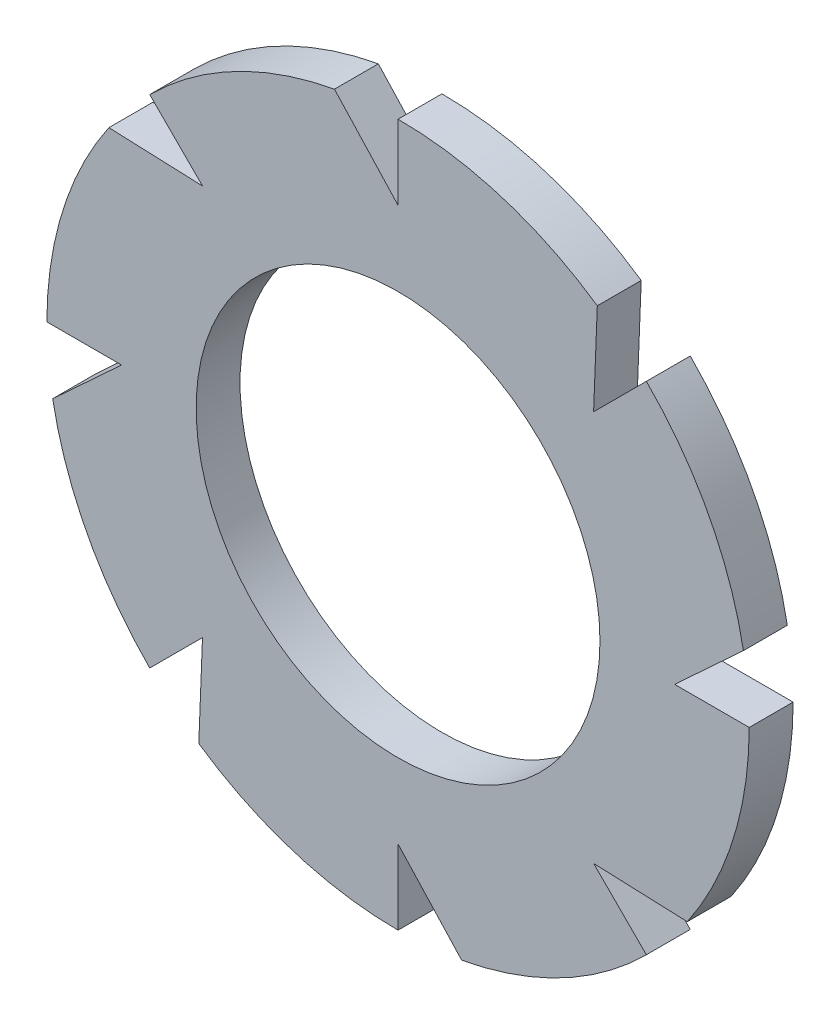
ISO-10303-21;
HEADER;
FILE_DESCRIPTION(('STEP AP214'),'2;1');
FILE_NAME('part.step','',(''),(''),'','','');
FILE_SCHEMA(('AUTOMOTIVE_DESIGN { 1 0 10303 214 1 1 1 1 }'));
ENDSEC;
DATA;
#1=APPLICATION_CONTEXT('core data for automotive mechanical design processes');
#2=APPLICATION_PROTOCOL_DEFINITION('international standard','automotive_design',2000,#1);
#3=PRODUCT_CONTEXT('',#1,'mechanical');
#4=PRODUCT('Part','Part','',(#3));
#5=PRODUCT_RELATED_PRODUCT_CATEGORY('part','',(#4));
#6=PRODUCT_DEFINITION_FORMATION('','',#4);
#7=PRODUCT_DEFINITION_CONTEXT('part definition',#1,'design');
#8=PRODUCT_DEFINITION('design','',#6,#7);
#9=PRODUCT_DEFINITION_SHAPE('','',#8);
#10=(LENGTH_UNIT() NAMED_UNIT(*) SI_UNIT(.MILLI.,.METRE.));
#11=(NAMED_UNIT(*) PLANE_ANGLE_UNIT() SI_UNIT($,.RADIAN.));
#12=(NAMED_UNIT(*) SI_UNIT($,.STERADIAN.) SOLID_ANGLE_UNIT());
#13=UNCERTAINTY_MEASURE_WITH_UNIT(LENGTH_MEASURE(1.E-05),#10,'distance_accuracy_value','');
#14=(GEOMETRIC_REPRESENTATION_CONTEXT(3) GLOBAL_UNCERTAINTY_ASSIGNED_CONTEXT((#13)) GLOBAL_UNIT_ASSIGNED_CONTEXT((#10,
#11,#12)) REPRESENTATION_CONTEXT('',''));
#15=CARTESIAN_POINT('',(0.,0.,0.));
#16=DIRECTION('',(0.,0.,1.));
#17=DIRECTION('',(1.,0.,0.));
#18=AXIS2_PLACEMENT_3D('',#15,#16,#17);
#19=CARTESIAN_POINT('',(0.,0.,-0.5));
#20=DIRECTION('',(0.,0.,1.));
#21=DIRECTION('',(1.,0.,0.));
#22=AXIS2_PLACEMENT_3D('',#19,#20,#21);
#23=CYLINDRICAL_SURFACE('',#22,4.);
#24=DIRECTION('',(0.,0.,1.));
#25=VECTOR('',#24,1.);
#26=CARTESIAN_POINT('',(2.82842712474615,2.82842712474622,-0.5));
#27=LINE('',#26,#25);
#28=CARTESIAN_POINT('',(2.82842712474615,2.82842712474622,-0.5));
#29=VERTEX_POINT('',#28);
#30=CARTESIAN_POINT('',(2.82842712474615,2.82842712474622,-1.70530256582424E-10));
#31=VERTEX_POINT('',#30);
#32=EDGE_CURVE('E198',#29,#31,#27,.T.);
#33=ORIENTED_EDGE('',*,*,#32,.T.);
#34=CARTESIAN_POINT('',(0.,0.,0.));
#35=DIRECTION('',(0.,0.,1.));
#36=DIRECTION('',(1.,0.,0.));
#37=AXIS2_PLACEMENT_3D('',#34,#35,#36);
#38=CIRCLE('',#37,4.);
#39=CARTESIAN_POINT('',(3.93387713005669,0.72430016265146,0.));
#40=VERTEX_POINT('',#39);
#41=EDGE_CURVE('E373',#40,#31,#38,.T.);
#42=ORIENTED_EDGE('',*,*,#41,.F.);
#43=DIRECTION('',(0.,0.,1.));
#44=VECTOR('',#43,1.);
#45=CARTESIAN_POINT('',(3.93387713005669,0.72430016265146,-0.5));
#46=LINE('',#45,#44);
#47=CARTESIAN_POINT('',(3.93387713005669,0.72430016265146,-0.5));
#48=VERTEX_POINT('',#47);
#49=EDGE_CURVE('E55',#48,#40,#46,.T.);
#50=ORIENTED_EDGE('',*,*,#49,.F.);
#51=CARTESIAN_POINT('',(0.,0.,-0.5));
#52=DIRECTION('',(0.,0.,1.));
#53=DIRECTION('',(1.,0.,0.));
#54=AXIS2_PLACEMENT_3D('',#51,#52,#53);
#55=CIRCLE('',#54,4.);
#56=EDGE_CURVE('E384',#48,#29,#55,.T.);
#57=ORIENTED_EDGE('',*,*,#56,.T.);
#58=EDGE_LOOP('',(#33,#42,#50,#57));
#59=FACE_BOUND('',#58,.T.);
#60=ADVANCED_FACE('F33',(#59),#23,.T.);
#61=DIRECTION('',(0.,0.,1.));
#62=VECTOR('',#61,1.);
#63=CARTESIAN_POINT('',(4.,0.,-0.5));
#64=LINE('',#63,#62);
#65=CARTESIAN_POINT('',(4.,0.,-0.5));
#66=VERTEX_POINT('',#65);
#67=CARTESIAN_POINT('',(4.,0.,-1.70530256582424E-10));
#68=VERTEX_POINT('',#67);
#69=EDGE_CURVE('E227',#66,#68,#64,.T.);
#70=ORIENTED_EDGE('',*,*,#69,.T.);
#71=CARTESIAN_POINT('',(3.29382875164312,-2.2695136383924,0.));
#72=VERTEX_POINT('',#71);
#73=EDGE_CURVE('E368',#72,#68,#38,.T.);
#74=ORIENTED_EDGE('',*,*,#73,.F.);
#75=DIRECTION('',(0.,0.,1.));
#76=VECTOR('',#75,1.);
#77=CARTESIAN_POINT('',(3.29382875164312,-2.2695136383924,-0.5));
#78=LINE('',#77,#76);
#79=CARTESIAN_POINT('',(3.29382875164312,-2.2695136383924,-0.5));
#80=VERTEX_POINT('',#79);
#81=EDGE_CURVE('E245',#80,#72,#78,.T.);
#82=ORIENTED_EDGE('',*,*,#81,.F.);
#83=EDGE_CURVE('E385',#80,#66,#55,.T.);
#84=ORIENTED_EDGE('',*,*,#83,.T.);
#85=EDGE_LOOP('',(#70,#74,#82,#84));
#86=FACE_BOUND('',#85,.T.);
#87=ADVANCED_FACE('F440',(#86),#23,.T.);
#88=DIRECTION('',(0.,0.,1.));
#89=VECTOR('',#88,1.);
#90=CARTESIAN_POINT('',(2.82842712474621,-2.82842712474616,-0.5));
#91=LINE('',#90,#89);
#92=CARTESIAN_POINT('',(2.82842712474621,-2.82842712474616,-0.5));
#93=VERTEX_POINT('',#92);
#94=CARTESIAN_POINT('',(2.82842712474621,-2.82842712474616,-1.70530256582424E-10));
#95=VERTEX_POINT('',#94);
#96=EDGE_CURVE('E242',#93,#95,#91,.T.);
#97=ORIENTED_EDGE('',*,*,#96,.T.);
#98=CARTESIAN_POINT('',(0.724300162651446,-3.93387713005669,0.));
#99=VERTEX_POINT('',#98);
#100=EDGE_CURVE('E372',#99,#95,#38,.T.);
#101=ORIENTED_EDGE('',*,*,#100,.F.);
#102=DIRECTION('',(0.,0.,1.));
#103=VECTOR('',#102,1.);
#104=CARTESIAN_POINT('',(0.724300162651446,-3.93387713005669,-0.5));
#105=LINE('',#104,#103);
#106=CARTESIAN_POINT('',(0.724300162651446,-3.93387713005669,-0.5));
#107=VERTEX_POINT('',#106);
#108=EDGE_CURVE('E261',#107,#99,#105,.T.);
#109=ORIENTED_EDGE('',*,*,#108,.F.);
#110=EDGE_CURVE('E388',#107,#93,#55,.T.);
#111=ORIENTED_EDGE('',*,*,#110,.T.);
#112=EDGE_LOOP('',(#97,#101,#109,#111));
#113=FACE_BOUND('',#112,.T.);
#114=ADVANCED_FACE('F434',(#113),#23,.T.);
#115=DIRECTION('',(0.,0.,1.));
#116=VECTOR('',#115,1.);
#117=CARTESIAN_POINT('',(0.,-4.,-0.5));
#118=LINE('',#117,#116);
#119=CARTESIAN_POINT('',(0.,-4.,-0.5));
#120=VERTEX_POINT('',#119);
#121=CARTESIAN_POINT('',(0.,-4.,-1.70530256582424E-10));
#122=VERTEX_POINT('',#121);
#123=EDGE_CURVE('E258',#120,#122,#118,.T.);
#124=ORIENTED_EDGE('',*,*,#123,.T.);
#125=CARTESIAN_POINT('',(-2.26951363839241,-3.29382875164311,0.));
#126=VERTEX_POINT('',#125);
#127=EDGE_CURVE('E375',#126,#122,#38,.T.);
#128=ORIENTED_EDGE('',*,*,#127,.F.);
#129=DIRECTION('',(0.,0.,1.));
#130=VECTOR('',#129,1.);
#131=CARTESIAN_POINT('',(-2.26951363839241,-3.29382875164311,-0.5));
#132=LINE('',#131,#130);
#133=CARTESIAN_POINT('',(-2.26951363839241,-3.29382875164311,-0.5));
#134=VERTEX_POINT('',#133);
#135=EDGE_CURVE('E277',#134,#126,#132,.T.);
#136=ORIENTED_EDGE('',*,*,#135,.F.);
#137=EDGE_CURVE('E391',#134,#120,#55,.T.);
#138=ORIENTED_EDGE('',*,*,#137,.T.);
#139=EDGE_LOOP('',(#124,#128,#136,#138));
#140=FACE_BOUND('',#139,.T.);
#141=ADVANCED_FACE('F427',(#140),#23,.T.);
#142=DIRECTION('',(0.,0.,1.));
#143=VECTOR('',#142,1.);
#144=CARTESIAN_POINT('',(-2.82842712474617,-2.8284271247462,-0.5));
#145=LINE('',#144,#143);
#146=CARTESIAN_POINT('',(-2.82842712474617,-2.8284271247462,-0.5));
#147=VERTEX_POINT('',#146);
#148=CARTESIAN_POINT('',(-2.82842712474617,-2.8284271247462,-1.70530256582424E-10));
#149=VERTEX_POINT('',#148);
#150=EDGE_CURVE('E274',#147,#149,#145,.T.);
#151=ORIENTED_EDGE('',*,*,#150,.T.);
#152=CARTESIAN_POINT('',(-3.93387713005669,-0.724300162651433,0.));
#153=VERTEX_POINT('',#152);
#154=EDGE_CURVE('E420',#153,#149,#38,.T.);
#155=ORIENTED_EDGE('',*,*,#154,.F.);
#156=DIRECTION('',(0.,0.,1.));
#157=VECTOR('',#156,1.);
#158=CARTESIAN_POINT('',(-3.93387713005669,-0.724300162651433,-0.5));
#159=LINE('',#158,#157);
#160=CARTESIAN_POINT('',(-3.93387713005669,-0.724300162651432,-0.5));
#161=VERTEX_POINT('',#160);
#162=EDGE_CURVE('E293',#161,#153,#159,.T.);
#163=ORIENTED_EDGE('',*,*,#162,.F.);
#164=EDGE_CURVE('E396',#161,#147,#55,.T.);
#165=ORIENTED_EDGE('',*,*,#164,.T.);
#166=EDGE_LOOP('',(#151,#155,#163,#165));
#167=FACE_BOUND('',#166,.T.);
#168=ADVANCED_FACE('F457',(#167),#23,.T.);
#169=DIRECTION('',(0.,0.,1.));
#170=VECTOR('',#169,1.);
#171=CARTESIAN_POINT('',(-4.,0.,-0.5));
#172=LINE('',#171,#170);
#173=CARTESIAN_POINT('',(-4.,0.,-0.5));
#174=VERTEX_POINT('',#173);
#175=CARTESIAN_POINT('',(-4.,0.,-1.70530256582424E-10));
#176=VERTEX_POINT('',#175);
#177=EDGE_CURVE('E290',#174,#176,#172,.T.);
#178=ORIENTED_EDGE('',*,*,#177,.T.);
#179=CARTESIAN_POINT('',(-3.2938287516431,2.26951363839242,0.));
#180=VERTEX_POINT('',#179);
#181=EDGE_CURVE('E344',#180,#176,#38,.T.);
#182=ORIENTED_EDGE('',*,*,#181,.F.);
#183=DIRECTION('',(0.,0.,1.));
#184=VECTOR('',#183,1.);
#185=CARTESIAN_POINT('',(-3.2938287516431,2.26951363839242,-0.5));
#186=LINE('',#185,#184);
#187=CARTESIAN_POINT('',(-3.29382875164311,2.26951363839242,-0.5));
#188=VERTEX_POINT('',#187);
#189=EDGE_CURVE('E309',#188,#180,#186,.T.);
#190=ORIENTED_EDGE('',*,*,#189,.F.);
#191=EDGE_CURVE('E340',#188,#174,#55,.T.);
#192=ORIENTED_EDGE('',*,*,#191,.T.);
#193=EDGE_LOOP('',(#178,#182,#190,#192));
#194=FACE_BOUND('',#193,.T.);
#195=ADVANCED_FACE('F408',(#194),#23,.T.);
#196=DIRECTION('',(0.,0.,1.));
#197=VECTOR('',#196,1.);
#198=CARTESIAN_POINT('',(-2.82842712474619,2.82842712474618,-0.5));
#199=LINE('',#198,#197);
#200=CARTESIAN_POINT('',(-2.82842712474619,2.82842712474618,-0.5));
#201=VERTEX_POINT('',#200);
#202=CARTESIAN_POINT('',(-2.82842712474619,2.82842712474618,-1.70530256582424E-10));
#203=VERTEX_POINT('',#202);
#204=EDGE_CURVE('E306',#201,#203,#199,.T.);
#205=ORIENTED_EDGE('',*,*,#204,.T.);
#206=CARTESIAN_POINT('',(-0.724300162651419,3.9338771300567,0.));
#207=VERTEX_POINT('',#206);
#208=EDGE_CURVE('E341',#207,#203,#38,.T.);
#209=ORIENTED_EDGE('',*,*,#208,.F.);
#210=DIRECTION('',(0.,0.,1.));
#211=VECTOR('',#210,1.);
#212=CARTESIAN_POINT('',(-0.724300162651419,3.9338771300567,-0.5));
#213=LINE('',#212,#211);
#214=CARTESIAN_POINT('',(-0.724300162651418,3.9338771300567,-0.5));
#215=VERTEX_POINT('',#214);
#216=EDGE_CURVE('E325',#215,#207,#213,.T.);
#217=ORIENTED_EDGE('',*,*,#216,.F.);
#218=EDGE_CURVE('E336',#215,#201,#55,.T.);
#219=ORIENTED_EDGE('',*,*,#218,.T.);
#220=EDGE_LOOP('',(#205,#209,#217,#219));
#221=FACE_BOUND('',#220,.T.);
#222=ADVANCED_FACE('F446',(#221),#23,.T.);
#223=DIRECTION('',(0.,0.,1.));
#224=VECTOR('',#223,1.);
#225=CARTESIAN_POINT('',(2.26951363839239,3.29382875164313,-0.5));
#226=LINE('',#225,#224);
#227=CARTESIAN_POINT('',(2.26951363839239,3.29382875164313,-0.5));
#228=VERTEX_POINT('',#227);
#229=CARTESIAN_POINT('',(2.26951363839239,3.29382875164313,0.));
#230=VERTEX_POINT('',#229);
#231=EDGE_CURVE('E47',#228,#230,#226,.T.);
#232=ORIENTED_EDGE('',*,*,#231,.F.);
#233=CARTESIAN_POINT('',(0.,4.,-0.5));
#234=VERTEX_POINT('',#233);
#235=EDGE_CURVE('E211',#228,#234,#55,.T.);
#236=ORIENTED_EDGE('',*,*,#235,.T.);
#237=DIRECTION('',(0.,0.,1.));
#238=VECTOR('',#237,1.);
#239=CARTESIAN_POINT('',(0.,4.,-0.5));
#240=LINE('',#239,#238);
#241=CARTESIAN_POINT('',(0.,4.,-1.70530256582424E-10));
#242=VERTEX_POINT('',#241);
#243=EDGE_CURVE('E322',#234,#242,#240,.T.);
#244=ORIENTED_EDGE('',*,*,#243,.T.);
#245=EDGE_CURVE('E333',#230,#242,#38,.T.);
#246=ORIENTED_EDGE('',*,*,#245,.F.);
#247=EDGE_LOOP('',(#232,#236,#244,#246));
#248=FACE_BOUND('',#247,.T.);
#249=ADVANCED_FACE('F35',(#248),#23,.T.);
#250=CARTESIAN_POINT('',(0.,0.,-0.5));
#251=DIRECTION('',(0.,0.,1.));
#252=DIRECTION('',(1.,0.,0.));
#253=AXIS2_PLACEMENT_3D('',#250,#251,#252);
#254=PLANE('',#253);
#255=CARTESIAN_POINT('',(0.,0.,-0.5));
#256=DIRECTION('',(0.,0.,1.));
#257=DIRECTION('',(1.,0.,0.));
#258=AXIS2_PLACEMENT_3D('',#255,#256,#257);
#259=CIRCLE('',#258,2.3);
#260=CARTESIAN_POINT('',(2.3,0.,-0.5));
#261=VERTEX_POINT('',#260);
#262=EDGE_CURVE('E330',#261,#261,#259,.T.);
#263=ORIENTED_EDGE('',*,*,#262,.T.);
#264=EDGE_LOOP('',(#263));
#265=FACE_BOUND('',#264,.T.);
#266=DIRECTION('',(-0.0394718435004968,-0.999220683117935,0.));
#267=VECTOR('',#266,1.);
#268=CARTESIAN_POINT('',(2.2273863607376,2.22738636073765,-0.5));
#269=LINE('',#268,#267);
#270=CARTESIAN_POINT('',(2.2273863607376,2.22738636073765,-0.5));
#271=VERTEX_POINT('',#270);
#272=EDGE_CURVE('E195',#228,#271,#269,.T.);
#273=ORIENTED_EDGE('',*,*,#272,.T.);
#274=DIRECTION('',(0.707106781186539,0.707106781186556,0.));
#275=VECTOR('',#274,1.);
#276=CARTESIAN_POINT('',(2.82842712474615,2.82842712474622,-0.5));
#277=LINE('',#276,#275);
#278=EDGE_CURVE('E199',#271,#29,#277,.T.);
#279=ORIENTED_EDGE('',*,*,#278,.T.);
#280=ORIENTED_EDGE('',*,*,#56,.F.);
#281=DIRECTION('',(-0.734466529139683,-0.678644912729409,0.));
#282=VECTOR('',#281,1.);
#283=CARTESIAN_POINT('',(3.15,0.,-0.5));
#284=LINE('',#283,#282);
#285=CARTESIAN_POINT('',(3.15,0.,-0.5));
#286=VERTEX_POINT('',#285);
#287=EDGE_CURVE('E219',#48,#286,#284,.T.);
#288=ORIENTED_EDGE('',*,*,#287,.T.);
#289=DIRECTION('',(1.,0.,0.));
#290=VECTOR('',#289,1.);
#291=CARTESIAN_POINT('',(4.,0.,-0.5));
#292=LINE('',#291,#290);
#293=EDGE_CURVE('E222',#286,#66,#292,.T.);
#294=ORIENTED_EDGE('',*,*,#293,.T.);
#295=ORIENTED_EDGE('',*,*,#83,.F.);
#296=DIRECTION('',(-0.999220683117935,0.0394718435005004,0.));
#297=VECTOR('',#296,1.);
#298=CARTESIAN_POINT('',(2.22738636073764,-2.2273863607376,-0.5));
#299=LINE('',#298,#297);
#300=CARTESIAN_POINT('',(2.22738636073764,-2.2273863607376,-0.5));
#301=VERTEX_POINT('',#300);
#302=EDGE_CURVE('E234',#80,#301,#299,.T.);
#303=ORIENTED_EDGE('',*,*,#302,.T.);
#304=DIRECTION('',(0.707106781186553,-0.707106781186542,0.));
#305=VECTOR('',#304,1.);
#306=CARTESIAN_POINT('',(2.82842712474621,-2.82842712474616,-0.5));
#307=LINE('',#306,#305);
#308=EDGE_CURVE('E237',#301,#93,#307,.T.);
#309=ORIENTED_EDGE('',*,*,#308,.T.);
#310=ORIENTED_EDGE('',*,*,#110,.F.);
#311=DIRECTION('',(-0.678644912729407,0.734466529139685,0.));
#312=VECTOR('',#311,1.);
#313=CARTESIAN_POINT('',(0.,-3.15,-0.5));
#314=LINE('',#313,#312);
#315=CARTESIAN_POINT('',(0.,-3.15,-0.5));
#316=VERTEX_POINT('',#315);
#317=EDGE_CURVE('E250',#107,#316,#314,.T.);
#318=ORIENTED_EDGE('',*,*,#317,.T.);
#319=DIRECTION('',(0.,-1.,0.));
#320=VECTOR('',#319,1.);
#321=CARTESIAN_POINT('',(0.,-4.,-0.5));
#322=LINE('',#321,#320);
#323=EDGE_CURVE('E253',#316,#120,#322,.T.);
#324=ORIENTED_EDGE('',*,*,#323,.T.);
#325=ORIENTED_EDGE('',*,*,#137,.F.);
#326=DIRECTION('',(0.0394718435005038,0.999220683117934,0.));
#327=VECTOR('',#326,1.);
#328=CARTESIAN_POINT('',(-2.22738636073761,-2.22738636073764,-0.5));
#329=LINE('',#328,#327);
#330=CARTESIAN_POINT('',(-2.22738636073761,-2.22738636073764,-0.5));
#331=VERTEX_POINT('',#330);
#332=EDGE_CURVE('E266',#134,#331,#329,.T.);
#333=ORIENTED_EDGE('',*,*,#332,.T.);
#334=DIRECTION('',(-0.707106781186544,-0.707106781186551,0.));
#335=VECTOR('',#334,1.);
#336=CARTESIAN_POINT('',(-2.82842712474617,-2.8284271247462,-0.5));
#337=LINE('',#336,#335);
#338=EDGE_CURVE('E269',#331,#147,#337,.T.);
#339=ORIENTED_EDGE('',*,*,#338,.T.);
#340=ORIENTED_EDGE('',*,*,#164,.F.);
#341=DIRECTION('',(0.734466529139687,0.678644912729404,0.));
#342=VECTOR('',#341,1.);
#343=CARTESIAN_POINT('',(-3.15,0.,-0.5));
#344=LINE('',#343,#342);
#345=CARTESIAN_POINT('',(-3.15,0.,-0.5));
#346=VERTEX_POINT('',#345);
#347=EDGE_CURVE('E282',#161,#346,#344,.T.);
#348=ORIENTED_EDGE('',*,*,#347,.T.);
#349=DIRECTION('',(-1.,0.,0.));
#350=VECTOR('',#349,1.);
#351=CARTESIAN_POINT('',(-4.,0.,-0.5));
#352=LINE('',#351,#350);
#353=EDGE_CURVE('E285',#346,#174,#352,.T.);
#354=ORIENTED_EDGE('',*,*,#353,.T.);
#355=ORIENTED_EDGE('',*,*,#191,.F.);
#356=DIRECTION('',(0.999220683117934,-0.0394718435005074,0.));
#357=VECTOR('',#356,1.);
#358=CARTESIAN_POINT('',(-2.22738636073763,2.22738636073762,-0.5));
#359=LINE('',#358,#357);
#360=CARTESIAN_POINT('',(-2.22738636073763,2.22738636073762,-0.5));
#361=VERTEX_POINT('',#360);
#362=EDGE_CURVE('E298',#188,#361,#359,.T.);
#363=ORIENTED_EDGE('',*,*,#362,.T.);
#364=DIRECTION('',(-0.707106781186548,0.707106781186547,0.));
#365=VECTOR('',#364,1.);
#366=CARTESIAN_POINT('',(-2.82842712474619,2.82842712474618,-0.5));
#367=LINE('',#366,#365);
#368=EDGE_CURVE('E301',#361,#201,#367,.T.);
#369=ORIENTED_EDGE('',*,*,#368,.T.);
#370=ORIENTED_EDGE('',*,*,#218,.F.);
#371=DIRECTION('',(0.678644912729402,-0.73446652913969,0.));
#372=VECTOR('',#371,1.);
#373=CARTESIAN_POINT('',(0.,3.15,-0.5));
#374=LINE('',#373,#372);
#375=CARTESIAN_POINT('',(0.,3.15,-0.5));
#376=VERTEX_POINT('',#375);
#377=EDGE_CURVE('E314',#215,#376,#374,.T.);
#378=ORIENTED_EDGE('',*,*,#377,.T.);
#379=DIRECTION('',(0.,1.,0.));
#380=VECTOR('',#379,1.);
#381=CARTESIAN_POINT('',(0.,4.,-0.5));
#382=LINE('',#381,#380);
#383=EDGE_CURVE('E317',#376,#234,#382,.T.);
#384=ORIENTED_EDGE('',*,*,#383,.T.);
#385=ORIENTED_EDGE('',*,*,#235,.F.);
#386=EDGE_LOOP('',(#273,#279,#280,#288,#294,#295,#303,#309,#310,#318,#324,#325,#333,#339,#340,
#348,#354,#355,#363,#369,#370,#378,#384,#385));
#387=FACE_BOUND('',#386,.T.);
#388=ADVANCED_FACE('F209',(#265,#387),#254,.F.);
#389=CARTESIAN_POINT('',(0.,0.,0.));
#390=DIRECTION('',(0.,0.,1.));
#391=DIRECTION('',(1.,0.,0.));
#392=AXIS2_PLACEMENT_3D('',#389,#390,#391);
#393=PLANE('',#392);
#394=DIRECTION('',(0.707106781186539,0.707106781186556,0.));
#395=VECTOR('',#394,1.);
#396=CARTESIAN_POINT('',(2.82842712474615,2.82842712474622,-1.70530256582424E-10));
#397=LINE('',#396,#395);
#398=CARTESIAN_POINT('',(2.2273863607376,2.22738636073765,-1.70530256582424E-10));
#399=VERTEX_POINT('',#398);
#400=EDGE_CURVE('E212',#399,#31,#397,.T.);
#401=ORIENTED_EDGE('',*,*,#400,.F.);
#402=DIRECTION('',(-0.0394718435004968,-0.999220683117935,0.));
#403=VECTOR('',#402,1.);
#404=CARTESIAN_POINT('',(2.13606550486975,-0.0843802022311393,0.));
#405=LINE('',#404,#403);
#406=EDGE_CURVE('E11',#230,#399,#405,.T.);
#407=ORIENTED_EDGE('',*,*,#406,.F.);
#408=ORIENTED_EDGE('',*,*,#245,.T.);
#409=DIRECTION('',(0.,1.,0.));
#410=VECTOR('',#409,1.);
#411=CARTESIAN_POINT('',(0.,4.,-1.70530256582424E-10));
#412=LINE('',#411,#410);
#413=CARTESIAN_POINT('',(0.,3.15,-1.70530256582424E-10));
#414=VERTEX_POINT('',#413);
#415=EDGE_CURVE('E313',#414,#242,#412,.T.);
#416=ORIENTED_EDGE('',*,*,#415,.F.);
#417=DIRECTION('',(0.678644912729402,-0.73446652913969,0.));
#418=VECTOR('',#417,1.);
#419=CARTESIAN_POINT('',(1.57009221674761,1.45076059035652,0.));
#420=LINE('',#419,#418);
#421=EDGE_CURVE('E339',#207,#414,#420,.T.);
#422=ORIENTED_EDGE('',*,*,#421,.F.);
#423=ORIENTED_EDGE('',*,*,#208,.T.);
#424=DIRECTION('',(-0.707106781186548,0.707106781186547,0.));
#425=VECTOR('',#424,1.);
#426=CARTESIAN_POINT('',(-2.82842712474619,2.82842712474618,-1.70530256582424E-10));
#427=LINE('',#426,#425);
#428=CARTESIAN_POINT('',(-2.22738636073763,2.22738636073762,-1.70530256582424E-10));
#429=VERTEX_POINT('',#428);
#430=EDGE_CURVE('E297',#429,#203,#427,.T.);
#431=ORIENTED_EDGE('',*,*,#430,.F.);
#432=DIRECTION('',(0.999220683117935,-0.0394718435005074,0.));
#433=VECTOR('',#432,1.);
#434=CARTESIAN_POINT('',(0.0843802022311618,2.13606550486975,0.));
#435=LINE('',#434,#433);
#436=EDGE_CURVE('E346',#180,#429,#435,.T.);
#437=ORIENTED_EDGE('',*,*,#436,.F.);
#438=ORIENTED_EDGE('',*,*,#181,.T.);
#439=DIRECTION('',(-1.,0.,0.));
#440=VECTOR('',#439,1.);
#441=CARTESIAN_POINT('',(-4.,0.,-1.70530256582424E-10));
#442=LINE('',#441,#440);
#443=CARTESIAN_POINT('',(-3.15,0.,-1.70530256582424E-10));
#444=VERTEX_POINT('',#443);
#445=EDGE_CURVE('E281',#444,#176,#442,.T.);
#446=ORIENTED_EDGE('',*,*,#445,.F.);
#447=DIRECTION('',(0.734466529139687,0.678644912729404,0.));
#448=VECTOR('',#447,1.);
#449=CARTESIAN_POINT('',(-1.45076059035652,1.57009221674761,0.));
#450=LINE('',#449,#448);
#451=EDGE_CURVE('E348',#153,#444,#450,.T.);
#452=ORIENTED_EDGE('',*,*,#451,.F.);
#453=ORIENTED_EDGE('',*,*,#154,.T.);
#454=DIRECTION('',(-0.707106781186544,-0.707106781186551,0.));
#455=VECTOR('',#454,1.);
#456=CARTESIAN_POINT('',(-2.82842712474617,-2.8284271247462,-1.70530256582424E-10));
#457=LINE('',#456,#455);
#458=CARTESIAN_POINT('',(-2.22738636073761,-2.22738636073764,-1.70530256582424E-10));
#459=VERTEX_POINT('',#458);
#460=EDGE_CURVE('E265',#459,#149,#457,.T.);
#461=ORIENTED_EDGE('',*,*,#460,.F.);
#462=DIRECTION('',(0.0394718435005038,0.999220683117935,0.));
#463=VECTOR('',#462,1.);
#464=CARTESIAN_POINT('',(-2.13606550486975,0.0843802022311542,0.));
#465=LINE('',#464,#463);
#466=EDGE_CURVE('E350',#126,#459,#465,.T.);
#467=ORIENTED_EDGE('',*,*,#466,.F.);
#468=ORIENTED_EDGE('',*,*,#127,.T.);
#469=DIRECTION('',(0.,-1.,0.));
#470=VECTOR('',#469,1.);
#471=CARTESIAN_POINT('',(0.,-4.,-1.70530256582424E-10));
#472=LINE('',#471,#470);
#473=CARTESIAN_POINT('',(0.,-3.15,-1.70530256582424E-10));
#474=VERTEX_POINT('',#473);
#475=EDGE_CURVE('E249',#474,#122,#472,.T.);
#476=ORIENTED_EDGE('',*,*,#475,.F.);
#477=DIRECTION('',(-0.678644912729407,0.734466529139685,0.));
#478=VECTOR('',#477,1.);
#479=CARTESIAN_POINT('',(-1.5700922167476,-1.45076059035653,0.));
#480=LINE('',#479,#478);
#481=EDGE_CURVE('E352',#99,#474,#480,.T.);
#482=ORIENTED_EDGE('',*,*,#481,.F.);
#483=ORIENTED_EDGE('',*,*,#100,.T.);
#484=DIRECTION('',(0.707106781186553,-0.707106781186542,0.));
#485=VECTOR('',#484,1.);
#486=CARTESIAN_POINT('',(2.82842712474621,-2.82842712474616,-1.70530256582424E-10));
#487=LINE('',#486,#485);
#488=CARTESIAN_POINT('',(2.22738636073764,-2.2273863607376,-1.70530256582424E-10));
#489=VERTEX_POINT('',#488);
#490=EDGE_CURVE('E233',#489,#95,#487,.T.);
#491=ORIENTED_EDGE('',*,*,#490,.F.);
#492=DIRECTION('',(-0.999220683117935,0.0394718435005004,0.));
#493=VECTOR('',#492,1.);
#494=CARTESIAN_POINT('',(-0.0843802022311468,-2.13606550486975,0.));
#495=LINE('',#494,#493);
#496=EDGE_CURVE('E354',#72,#489,#495,.T.);
#497=ORIENTED_EDGE('',*,*,#496,.F.);
#498=ORIENTED_EDGE('',*,*,#73,.T.);
#499=DIRECTION('',(1.,0.,0.));
#500=VECTOR('',#499,1.);
#501=CARTESIAN_POINT('',(4.,0.,-1.70530256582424E-10));
#502=LINE('',#501,#500);
#503=CARTESIAN_POINT('',(3.15,0.,-1.70530256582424E-10));
#504=VERTEX_POINT('',#503);
#505=EDGE_CURVE('E218',#504,#68,#502,.T.);
#506=ORIENTED_EDGE('',*,*,#505,.F.);
#507=DIRECTION('',(-0.734466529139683,-0.678644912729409,0.));
#508=VECTOR('',#507,1.);
#509=CARTESIAN_POINT('',(1.45076059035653,-1.5700922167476,0.));
#510=LINE('',#509,#508);
#511=EDGE_CURVE('E41',#40,#504,#510,.T.);
#512=ORIENTED_EDGE('',*,*,#511,.F.);
#513=ORIENTED_EDGE('',*,*,#41,.T.);
#514=EDGE_LOOP('',(#401,#407,#408,#416,#422,#423,#431,#437,#438,#446,#452,#453,#461,#467,#468,
#476,#482,#483,#491,#497,#498,#506,#512,#513));
#515=FACE_BOUND('',#514,.T.);
#516=CARTESIAN_POINT('',(0.,0.,0.));
#517=DIRECTION('',(0.,0.,1.));
#518=DIRECTION('',(1.,0.,0.));
#519=AXIS2_PLACEMENT_3D('',#516,#517,#518);
#520=CIRCLE('',#519,2.3);
#521=CARTESIAN_POINT('',(2.3,0.,0.));
#522=VERTEX_POINT('',#521);
#523=EDGE_CURVE('E329',#522,#522,#520,.T.);
#524=ORIENTED_EDGE('',*,*,#523,.F.);
#525=EDGE_LOOP('',(#524));
#526=FACE_BOUND('',#525,.T.);
#527=ADVANCED_FACE('F364',(#515,#526),#393,.T.);
#528=CARTESIAN_POINT('',(0.,0.,-0.5));
#529=DIRECTION('',(0.,0.,1.));
#530=DIRECTION('',(1.,0.,0.));
#531=AXIS2_PLACEMENT_3D('',#528,#529,#530);
#532=CYLINDRICAL_SURFACE('',#531,2.3);
#533=ORIENTED_EDGE('',*,*,#262,.F.);
#534=EDGE_LOOP('',(#533));
#535=FACE_BOUND('',#534,.T.);
#536=ORIENTED_EDGE('',*,*,#523,.T.);
#537=EDGE_LOOP('',(#536));
#538=FACE_BOUND('',#537,.T.);
#539=ADVANCED_FACE('F481',(#535,#538),#532,.F.);
#540=CARTESIAN_POINT('',(0.,4.,-0.5));
#541=DIRECTION('',(1.,0.,0.));
#542=DIRECTION('',(0.,1.,0.));
#543=AXIS2_PLACEMENT_3D('',#540,#541,#542);
#544=PLANE('',#543);
#545=ORIENTED_EDGE('',*,*,#415,.T.);
#546=ORIENTED_EDGE('',*,*,#243,.F.);
#547=ORIENTED_EDGE('',*,*,#383,.F.);
#548=DIRECTION('',(0.,0.,1.));
#549=VECTOR('',#548,1.);
#550=CARTESIAN_POINT('',(0.,3.15,-0.5));
#551=LINE('',#550,#549);
#552=EDGE_CURVE('E319',#376,#414,#551,.T.);
#553=ORIENTED_EDGE('',*,*,#552,.T.);
#554=EDGE_LOOP('',(#545,#546,#547,#553));
#555=FACE_BOUND('',#554,.T.);
#556=ADVANCED_FACE('F382',(#555),#544,.F.);
#557=CARTESIAN_POINT('',(0.,3.15,-0.5));
#558=DIRECTION('',(-0.73446652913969,-0.678644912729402,0.));
#559=DIRECTION('',(0.678644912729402,-0.73446652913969,0.));
#560=AXIS2_PLACEMENT_3D('',#557,#558,#559);
#561=PLANE('',#560);
#562=ORIENTED_EDGE('',*,*,#216,.T.);
#563=ORIENTED_EDGE('',*,*,#421,.T.);
#564=ORIENTED_EDGE('',*,*,#552,.F.);
#565=ORIENTED_EDGE('',*,*,#377,.F.);
#566=EDGE_LOOP('',(#562,#563,#564,#565));
#567=FACE_BOUND('',#566,.T.);
#568=ADVANCED_FACE('F464',(#567),#561,.F.);
#569=CARTESIAN_POINT('',(-2.82842712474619,2.82842712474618,-0.5));
#570=DIRECTION('',(0.707106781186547,0.707106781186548,0.));
#571=DIRECTION('',(-0.707106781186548,0.707106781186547,0.));
#572=AXIS2_PLACEMENT_3D('',#569,#570,#571);
#573=PLANE('',#572);
#574=ORIENTED_EDGE('',*,*,#430,.T.);
#575=ORIENTED_EDGE('',*,*,#204,.F.);
#576=ORIENTED_EDGE('',*,*,#368,.F.);
#577=DIRECTION('',(0.,0.,1.));
#578=VECTOR('',#577,1.);
#579=CARTESIAN_POINT('',(-2.22738636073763,2.22738636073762,-0.5));
#580=LINE('',#579,#578);
#581=EDGE_CURVE('E304',#361,#429,#580,.T.);
#582=ORIENTED_EDGE('',*,*,#581,.T.);
#583=EDGE_LOOP('',(#574,#575,#576,#582));
#584=FACE_BOUND('',#583,.T.);
#585=ADVANCED_FACE('F465',(#584),#573,.F.);
#586=CARTESIAN_POINT('',(-2.22738636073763,2.22738636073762,-0.5));
#587=DIRECTION('',(-0.0394718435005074,-0.999220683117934,0.));
#588=DIRECTION('',(0.999220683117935,-0.0394718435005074,0.));
#589=AXIS2_PLACEMENT_3D('',#586,#587,#588);
#590=PLANE('',#589);
#591=ORIENTED_EDGE('',*,*,#189,.T.);
#592=ORIENTED_EDGE('',*,*,#436,.T.);
#593=ORIENTED_EDGE('',*,*,#581,.F.);
#594=ORIENTED_EDGE('',*,*,#362,.F.);
#595=EDGE_LOOP('',(#591,#592,#593,#594));
#596=FACE_BOUND('',#595,.T.);
#597=ADVANCED_FACE('F467',(#596),#590,.F.);
#598=CARTESIAN_POINT('',(-4.,0.,-0.5));
#599=DIRECTION('',(0.,1.,0.));
#600=DIRECTION('',(-1.,0.,0.));
#601=AXIS2_PLACEMENT_3D('',#598,#599,#600);
#602=PLANE('',#601);
#603=ORIENTED_EDGE('',*,*,#445,.T.);
#604=ORIENTED_EDGE('',*,*,#177,.F.);
#605=ORIENTED_EDGE('',*,*,#353,.F.);
#606=DIRECTION('',(0.,0.,1.));
#607=VECTOR('',#606,1.);
#608=CARTESIAN_POINT('',(-3.15,0.,-0.5));
#609=LINE('',#608,#607);
#610=EDGE_CURVE('E288',#346,#444,#609,.T.);
#611=ORIENTED_EDGE('',*,*,#610,.T.);
#612=EDGE_LOOP('',(#603,#604,#605,#611));
#613=FACE_BOUND('',#612,.T.);
#614=ADVANCED_FACE('F413',(#613),#602,.F.);
#615=CARTESIAN_POINT('',(-3.15,0.,-0.5));
#616=DIRECTION('',(0.678644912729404,-0.734466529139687,0.));
#617=DIRECTION('',(0.734466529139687,0.678644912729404,0.));
#618=AXIS2_PLACEMENT_3D('',#615,#616,#617);
#619=PLANE('',#618);
#620=ORIENTED_EDGE('',*,*,#162,.T.);
#621=ORIENTED_EDGE('',*,*,#451,.T.);
#622=ORIENTED_EDGE('',*,*,#610,.F.);
#623=ORIENTED_EDGE('',*,*,#347,.F.);
#624=EDGE_LOOP('',(#620,#621,#622,#623));
#625=FACE_BOUND('',#624,.T.);
#626=ADVANCED_FACE('F474',(#625),#619,.F.);
#627=CARTESIAN_POINT('',(-2.82842712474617,-2.8284271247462,-0.5));
#628=DIRECTION('',(-0.707106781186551,0.707106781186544,0.));
#629=DIRECTION('',(-0.707106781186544,-0.707106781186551,0.));
#630=AXIS2_PLACEMENT_3D('',#627,#628,#629);
#631=PLANE('',#630);
#632=ORIENTED_EDGE('',*,*,#460,.T.);
#633=ORIENTED_EDGE('',*,*,#150,.F.);
#634=ORIENTED_EDGE('',*,*,#338,.F.);
#635=DIRECTION('',(0.,0.,1.));
#636=VECTOR('',#635,1.);
#637=CARTESIAN_POINT('',(-2.22738636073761,-2.22738636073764,-0.5));
#638=LINE('',#637,#636);
#639=EDGE_CURVE('E272',#331,#459,#638,.T.);
#640=ORIENTED_EDGE('',*,*,#639,.T.);
#641=EDGE_LOOP('',(#632,#633,#634,#640));
#642=FACE_BOUND('',#641,.T.);
#643=ADVANCED_FACE('F527',(#642),#631,.F.);
#644=CARTESIAN_POINT('',(-2.22738636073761,-2.22738636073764,-0.5));
#645=DIRECTION('',(0.999220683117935,-0.0394718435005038,0.));
#646=DIRECTION('',(0.0394718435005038,0.999220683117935,0.));
#647=AXIS2_PLACEMENT_3D('',#644,#645,#646);
#648=PLANE('',#647);
#649=ORIENTED_EDGE('',*,*,#135,.T.);
#650=ORIENTED_EDGE('',*,*,#466,.T.);
#651=ORIENTED_EDGE('',*,*,#639,.F.);
#652=ORIENTED_EDGE('',*,*,#332,.F.);
#653=EDGE_LOOP('',(#649,#650,#651,#652));
#654=FACE_BOUND('',#653,.T.);
#655=ADVANCED_FACE('F536',(#654),#648,.F.);
#656=CARTESIAN_POINT('',(0.,-4.,-0.5));
#657=DIRECTION('',(-1.,0.,0.));
#658=DIRECTION('',(0.,-1.,0.));
#659=AXIS2_PLACEMENT_3D('',#656,#657,#658);
#660=PLANE('',#659);
#661=ORIENTED_EDGE('',*,*,#475,.T.);
#662=ORIENTED_EDGE('',*,*,#123,.F.);
#663=ORIENTED_EDGE('',*,*,#323,.F.);
#664=DIRECTION('',(0.,0.,1.));
#665=VECTOR('',#664,1.);
#666=CARTESIAN_POINT('',(0.,-3.15,-0.5));
#667=LINE('',#666,#665);
#668=EDGE_CURVE('E256',#316,#474,#667,.T.);
#669=ORIENTED_EDGE('',*,*,#668,.T.);
#670=EDGE_LOOP('',(#661,#662,#663,#669));
#671=FACE_BOUND('',#670,.T.);
#672=ADVANCED_FACE('F430',(#671),#660,.F.);
#673=CARTESIAN_POINT('',(0.,-3.15,-0.5));
#674=DIRECTION('',(0.734466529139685,0.678644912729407,0.));
#675=DIRECTION('',(-0.678644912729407,0.734466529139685,0.));
#676=AXIS2_PLACEMENT_3D('',#673,#674,#675);
#677=PLANE('',#676);
#678=ORIENTED_EDGE('',*,*,#108,.T.);
#679=ORIENTED_EDGE('',*,*,#481,.T.);
#680=ORIENTED_EDGE('',*,*,#668,.F.);
#681=ORIENTED_EDGE('',*,*,#317,.F.);
#682=EDGE_LOOP('',(#678,#679,#680,#681));
#683=FACE_BOUND('',#682,.T.);
#684=ADVANCED_FACE('F432',(#683),#677,.F.);
#685=CARTESIAN_POINT('',(2.82842712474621,-2.82842712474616,-0.5));
#686=DIRECTION('',(-0.707106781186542,-0.707106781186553,0.));
#687=DIRECTION('',(0.707106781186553,-0.707106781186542,0.));
#688=AXIS2_PLACEMENT_3D('',#685,#686,#687);
#689=PLANE('',#688);
#690=ORIENTED_EDGE('',*,*,#490,.T.);
#691=ORIENTED_EDGE('',*,*,#96,.F.);
#692=ORIENTED_EDGE('',*,*,#308,.F.);
#693=DIRECTION('',(0.,0.,1.));
#694=VECTOR('',#693,1.);
#695=CARTESIAN_POINT('',(2.22738636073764,-2.2273863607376,-0.5));
#696=LINE('',#695,#694);
#697=EDGE_CURVE('E240',#301,#489,#696,.T.);
#698=ORIENTED_EDGE('',*,*,#697,.T.);
#699=EDGE_LOOP('',(#690,#691,#692,#698));
#700=FACE_BOUND('',#699,.T.);
#701=ADVANCED_FACE('F436',(#700),#689,.F.);
#702=CARTESIAN_POINT('',(2.22738636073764,-2.2273863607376,-0.5));
#703=DIRECTION('',(0.0394718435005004,0.999220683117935,0.));
#704=DIRECTION('',(-0.999220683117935,0.0394718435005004,0.));
#705=AXIS2_PLACEMENT_3D('',#702,#703,#704);
#706=PLANE('',#705);
#707=ORIENTED_EDGE('',*,*,#81,.T.);
#708=ORIENTED_EDGE('',*,*,#496,.T.);
#709=ORIENTED_EDGE('',*,*,#697,.F.);
#710=ORIENTED_EDGE('',*,*,#302,.F.);
#711=EDGE_LOOP('',(#707,#708,#709,#710));
#712=FACE_BOUND('',#711,.T.);
#713=ADVANCED_FACE('F439',(#712),#706,.F.);
#714=CARTESIAN_POINT('',(4.,0.,-0.5));
#715=DIRECTION('',(0.,-1.,0.));
#716=DIRECTION('',(1.,0.,0.));
#717=AXIS2_PLACEMENT_3D('',#714,#715,#716);
#718=PLANE('',#717);
#719=ORIENTED_EDGE('',*,*,#505,.T.);
#720=ORIENTED_EDGE('',*,*,#69,.F.);
#721=ORIENTED_EDGE('',*,*,#293,.F.);
#722=DIRECTION('',(0.,0.,1.));
#723=VECTOR('',#722,1.);
#724=CARTESIAN_POINT('',(3.15,0.,-0.5));
#725=LINE('',#724,#723);
#726=EDGE_CURVE('E225',#286,#504,#725,.T.);
#727=ORIENTED_EDGE('',*,*,#726,.T.);
#728=EDGE_LOOP('',(#719,#720,#721,#727));
#729=FACE_BOUND('',#728,.T.);
#730=ADVANCED_FACE('F362',(#729),#718,.F.);
#731=CARTESIAN_POINT('',(3.15,0.,-0.5));
#732=DIRECTION('',(-0.678644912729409,0.734466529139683,0.));
#733=DIRECTION('',(-0.734466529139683,-0.678644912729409,0.));
#734=AXIS2_PLACEMENT_3D('',#731,#732,#733);
#735=PLANE('',#734);
#736=ORIENTED_EDGE('',*,*,#49,.T.);
#737=ORIENTED_EDGE('',*,*,#511,.T.);
#738=ORIENTED_EDGE('',*,*,#726,.F.);
#739=ORIENTED_EDGE('',*,*,#287,.F.);
#740=EDGE_LOOP('',(#736,#737,#738,#739));
#741=FACE_BOUND('',#740,.T.);
#742=ADVANCED_FACE('F355',(#741),#735,.F.);
#743=CARTESIAN_POINT('',(2.82842712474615,2.82842712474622,-0.5));
#744=DIRECTION('',(0.707106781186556,-0.707106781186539,0.));
#745=DIRECTION('',(0.707106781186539,0.707106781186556,0.));
#746=AXIS2_PLACEMENT_3D('',#743,#744,#745);
#747=PLANE('',#746);
#748=ORIENTED_EDGE('',*,*,#400,.T.);
#749=ORIENTED_EDGE('',*,*,#32,.F.);
#750=ORIENTED_EDGE('',*,*,#278,.F.);
#751=DIRECTION('',(0.,0.,1.));
#752=VECTOR('',#751,1.);
#753=CARTESIAN_POINT('',(2.2273863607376,2.22738636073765,-0.5));
#754=LINE('',#753,#752);
#755=EDGE_CURVE('E191',#271,#399,#754,.T.);
#756=ORIENTED_EDGE('',*,*,#755,.T.);
#757=EDGE_LOOP('',(#748,#749,#750,#756));
#758=FACE_BOUND('',#757,.T.);
#759=ADVANCED_FACE('F202',(#758),#747,.F.);
#760=CARTESIAN_POINT('',(2.2273863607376,2.22738636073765,-0.5));
#761=DIRECTION('',(-0.999220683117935,0.0394718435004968,0.));
#762=DIRECTION('',(-0.0394718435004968,-0.999220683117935,0.));
#763=AXIS2_PLACEMENT_3D('',#760,#761,#762);
#764=PLANE('',#763);
#765=ORIENTED_EDGE('',*,*,#231,.T.);
#766=ORIENTED_EDGE('',*,*,#406,.T.);
#767=ORIENTED_EDGE('',*,*,#755,.F.);
#768=ORIENTED_EDGE('',*,*,#272,.F.);
#769=EDGE_LOOP('',(#765,#766,#767,#768));
#770=FACE_BOUND('',#769,.T.);
#771=ADVANCED_FACE('F193',(#770),#764,.F.);
#772=CLOSED_SHELL('',(#60,#87,#114,#141,#168,#195,#222,#249,#388,#527,#539,#556,#568,#585,#597,
#614,#626,#643,#655,#672,#684,#701,#713,#730,#742,#759,#771));
#773=MANIFOLD_SOLID_BREP('B2',#772);
#774=ADVANCED_BREP_SHAPE_REPRESENTATION('',(#18,#773),#14);
#775=SHAPE_DEFINITION_REPRESENTATION(#9,#774);
ENDSEC;
END-ISO-10303-21;
